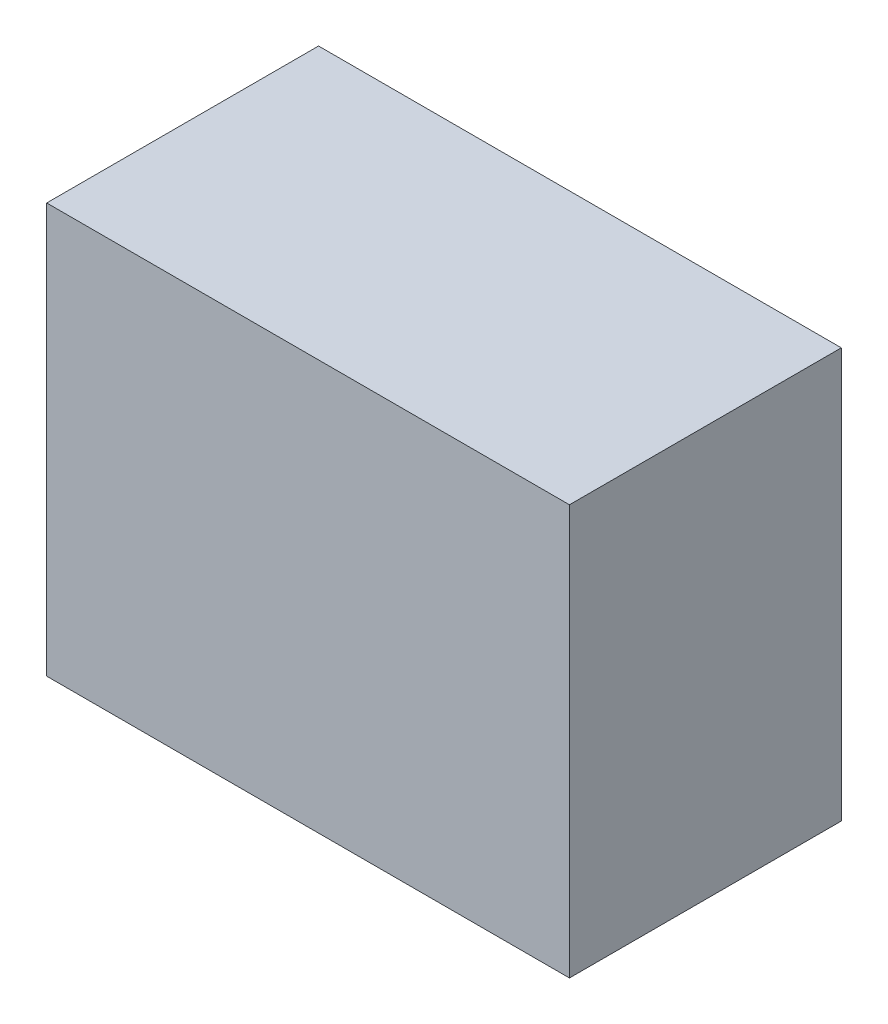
ISO-10303-21;
HEADER;
FILE_DESCRIPTION(('STEP AP214'),'2;1');
FILE_NAME('part.step','',(''),(''),'','','');
FILE_SCHEMA(('AUTOMOTIVE_DESIGN { 1 0 10303 214 1 1 1 1 }'));
ENDSEC;
DATA;
#1=APPLICATION_CONTEXT('core data for automotive mechanical design processes');
#2=APPLICATION_PROTOCOL_DEFINITION('international standard','automotive_design',2000,#1);
#3=PRODUCT_CONTEXT('',#1,'mechanical');
#4=PRODUCT('Part','Part','',(#3));
#5=PRODUCT_RELATED_PRODUCT_CATEGORY('part','',(#4));
#6=PRODUCT_DEFINITION_FORMATION('','',#4);
#7=PRODUCT_DEFINITION_CONTEXT('part definition',#1,'design');
#8=PRODUCT_DEFINITION('design','',#6,#7);
#9=PRODUCT_DEFINITION_SHAPE('','',#8);
#10=(LENGTH_UNIT() NAMED_UNIT(*) SI_UNIT(.MILLI.,.METRE.));
#11=(NAMED_UNIT(*) PLANE_ANGLE_UNIT() SI_UNIT($,.RADIAN.));
#12=(NAMED_UNIT(*) SI_UNIT($,.STERADIAN.) SOLID_ANGLE_UNIT());
#13=UNCERTAINTY_MEASURE_WITH_UNIT(LENGTH_MEASURE(1.E-05),#10,'distance_accuracy_value','');
#14=(GEOMETRIC_REPRESENTATION_CONTEXT(3) GLOBAL_UNCERTAINTY_ASSIGNED_CONTEXT((#13)) GLOBAL_UNIT_ASSIGNED_CONTEXT((#10,
#11,#12)) REPRESENTATION_CONTEXT('',''));
#15=CARTESIAN_POINT('',(0.,0.,0.));
#16=DIRECTION('',(0.,0.,1.));
#17=DIRECTION('',(1.,0.,0.));
#18=AXIS2_PLACEMENT_3D('',#15,#16,#17);
#19=CARTESIAN_POINT('',(-40.3021650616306,32.3007964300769,50.8));
#20=DIRECTION('',(1.,0.,0.));
#21=DIRECTION('',(0.,0.,-1.));
#22=AXIS2_PLACEMENT_3D('',#19,#20,#21);
#23=PLANE('',#22);
#24=DIRECTION('',(0.,-1.,0.));
#25=VECTOR('',#24,1.);
#26=CARTESIAN_POINT('',(-40.3021650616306,32.3007964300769,0.));
#27=LINE('',#26,#25);
#28=CARTESIAN_POINT('',(-40.3021650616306,32.3007964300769,0.));
#29=VERTEX_POINT('',#28);
#30=CARTESIAN_POINT('',(-40.3021650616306,-44.2826803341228,0.));
#31=VERTEX_POINT('',#30);
#32=EDGE_CURVE('E94',#29,#31,#27,.T.);
#33=ORIENTED_EDGE('',*,*,#32,.T.);
#34=DIRECTION('',(0.,0.,-1.));
#35=VECTOR('',#34,1.);
#36=CARTESIAN_POINT('',(-40.3021650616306,-44.2826803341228,50.8));
#37=LINE('',#36,#35);
#38=CARTESIAN_POINT('',(-40.3021650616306,-44.2826803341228,50.8));
#39=VERTEX_POINT('',#38);
#40=EDGE_CURVE('E11',#39,#31,#37,.T.);
#41=ORIENTED_EDGE('',*,*,#40,.F.);
#42=DIRECTION('',(0.,-1.,0.));
#43=VECTOR('',#42,1.);
#44=CARTESIAN_POINT('',(-40.3021650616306,32.3007964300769,50.8));
#45=LINE('',#44,#43);
#46=CARTESIAN_POINT('',(-40.3021650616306,32.3007964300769,50.8));
#47=VERTEX_POINT('',#46);
#48=EDGE_CURVE('E82',#47,#39,#45,.T.);
#49=ORIENTED_EDGE('',*,*,#48,.F.);
#50=DIRECTION('',(0.,0.,-1.));
#51=VECTOR('',#50,1.);
#52=CARTESIAN_POINT('',(-40.3021650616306,32.3007964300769,50.8));
#53=LINE('',#52,#51);
#54=EDGE_CURVE('E90',#47,#29,#53,.T.);
#55=ORIENTED_EDGE('',*,*,#54,.T.);
#56=EDGE_LOOP('',(#33,#41,#49,#55));
#57=FACE_BOUND('',#56,.T.);
#58=ADVANCED_FACE('F31',(#57),#23,.F.);
#59=CARTESIAN_POINT('',(-40.3021650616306,-44.2826803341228,50.8));
#60=DIRECTION('',(0.,1.,0.));
#61=DIRECTION('',(0.,0.,1.));
#62=AXIS2_PLACEMENT_3D('',#59,#60,#61);
#63=PLANE('',#62);
#64=DIRECTION('',(1.,0.,0.));
#65=VECTOR('',#64,1.);
#66=CARTESIAN_POINT('',(-40.3021650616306,-44.2826803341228,0.));
#67=LINE('',#66,#65);
#68=CARTESIAN_POINT('',(57.384314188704,-44.2826803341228,0.));
#69=VERTEX_POINT('',#68);
#70=EDGE_CURVE('E86',#31,#69,#67,.T.);
#71=ORIENTED_EDGE('',*,*,#70,.T.);
#72=DIRECTION('',(0.,0.,-1.));
#73=VECTOR('',#72,1.);
#74=CARTESIAN_POINT('',(57.384314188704,-44.2826803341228,50.8));
#75=LINE('',#74,#73);
#76=CARTESIAN_POINT('',(57.384314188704,-44.2826803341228,50.8));
#77=VERTEX_POINT('',#76);
#78=EDGE_CURVE('E39',#77,#69,#75,.T.);
#79=ORIENTED_EDGE('',*,*,#78,.F.);
#80=DIRECTION('',(1.,0.,0.));
#81=VECTOR('',#80,1.);
#82=CARTESIAN_POINT('',(-40.3021650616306,-44.2826803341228,50.8));
#83=LINE('',#82,#81);
#84=EDGE_CURVE('E77',#39,#77,#83,.T.);
#85=ORIENTED_EDGE('',*,*,#84,.F.);
#86=ORIENTED_EDGE('',*,*,#40,.T.);
#87=EDGE_LOOP('',(#71,#79,#85,#86));
#88=FACE_BOUND('',#87,.T.);
#89=ADVANCED_FACE('F85',(#88),#63,.F.);
#90=CARTESIAN_POINT('',(57.384314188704,32.3007964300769,50.8));
#91=DIRECTION('',(-1.,0.,0.));
#92=DIRECTION('',(0.,0.,1.));
#93=AXIS2_PLACEMENT_3D('',#90,#91,#92);
#94=PLANE('',#93);
#95=DIRECTION('',(0.,1.,0.));
#96=VECTOR('',#95,1.);
#97=CARTESIAN_POINT('',(57.384314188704,32.3007964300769,0.));
#98=LINE('',#97,#96);
#99=CARTESIAN_POINT('',(57.384314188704,32.3007964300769,0.));
#100=VERTEX_POINT('',#99);
#101=EDGE_CURVE('E64',#69,#100,#98,.T.);
#102=ORIENTED_EDGE('',*,*,#101,.T.);
#103=DIRECTION('',(0.,0.,-1.));
#104=VECTOR('',#103,1.);
#105=CARTESIAN_POINT('',(57.384314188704,32.3007964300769,50.8));
#106=LINE('',#105,#104);
#107=CARTESIAN_POINT('',(57.384314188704,32.3007964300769,50.8));
#108=VERTEX_POINT('',#107);
#109=EDGE_CURVE('E87',#108,#100,#106,.T.);
#110=ORIENTED_EDGE('',*,*,#109,.F.);
#111=DIRECTION('',(0.,1.,0.));
#112=VECTOR('',#111,1.);
#113=CARTESIAN_POINT('',(57.384314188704,32.3007964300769,50.8));
#114=LINE('',#113,#112);
#115=EDGE_CURVE('E80',#77,#108,#114,.T.);
#116=ORIENTED_EDGE('',*,*,#115,.F.);
#117=ORIENTED_EDGE('',*,*,#78,.T.);
#118=EDGE_LOOP('',(#102,#110,#116,#117));
#119=FACE_BOUND('',#118,.T.);
#120=ADVANCED_FACE('F88',(#119),#94,.F.);
#121=CARTESIAN_POINT('',(-40.3021650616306,32.3007964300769,50.8));
#122=DIRECTION('',(0.,-1.,0.));
#123=DIRECTION('',(0.,0.,-1.));
#124=AXIS2_PLACEMENT_3D('',#121,#122,#123);
#125=PLANE('',#124);
#126=DIRECTION('',(-1.,0.,0.));
#127=VECTOR('',#126,1.);
#128=CARTESIAN_POINT('',(-40.3021650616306,32.3007964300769,0.));
#129=LINE('',#128,#127);
#130=EDGE_CURVE('E70',#100,#29,#129,.T.);
#131=ORIENTED_EDGE('',*,*,#130,.T.);
#132=ORIENTED_EDGE('',*,*,#54,.F.);
#133=DIRECTION('',(-1.,0.,0.));
#134=VECTOR('',#133,1.);
#135=CARTESIAN_POINT('',(-40.3021650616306,32.3007964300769,50.8));
#136=LINE('',#135,#134);
#137=EDGE_CURVE('E47',#108,#47,#136,.T.);
#138=ORIENTED_EDGE('',*,*,#137,.F.);
#139=ORIENTED_EDGE('',*,*,#109,.T.);
#140=EDGE_LOOP('',(#131,#132,#138,#139));
#141=FACE_BOUND('',#140,.T.);
#142=ADVANCED_FACE('F101',(#141),#125,.F.);
#143=CARTESIAN_POINT('',(-40.3021650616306,-44.2826803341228,50.8));
#144=DIRECTION('',(0.,0.,1.));
#145=DIRECTION('',(1.,0.,0.));
#146=AXIS2_PLACEMENT_3D('',#143,#144,#145);
#147=PLANE('',#146);
#148=ORIENTED_EDGE('',*,*,#48,.T.);
#149=ORIENTED_EDGE('',*,*,#84,.T.);
#150=ORIENTED_EDGE('',*,*,#115,.T.);
#151=ORIENTED_EDGE('',*,*,#137,.T.);
#152=EDGE_LOOP('',(#148,#149,#150,#151));
#153=FACE_BOUND('',#152,.T.);
#154=ADVANCED_FACE('F78',(#153),#147,.T.);
#155=CARTESIAN_POINT('',(-40.3021650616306,-44.2826803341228,0.));
#156=DIRECTION('',(0.,0.,1.));
#157=DIRECTION('',(1.,0.,0.));
#158=AXIS2_PLACEMENT_3D('',#155,#156,#157);
#159=PLANE('',#158);
#160=ORIENTED_EDGE('',*,*,#32,.F.);
#161=ORIENTED_EDGE('',*,*,#130,.F.);
#162=ORIENTED_EDGE('',*,*,#101,.F.);
#163=ORIENTED_EDGE('',*,*,#70,.F.);
#164=EDGE_LOOP('',(#160,#161,#162,#163));
#165=FACE_BOUND('',#164,.T.);
#166=ADVANCED_FACE('F104',(#165),#159,.F.);
#167=CLOSED_SHELL('',(#58,#89,#120,#142,#154,#166));
#168=MANIFOLD_SOLID_BREP('B2',#167);
#169=ADVANCED_BREP_SHAPE_REPRESENTATION('',(#18,#168),#14);
#170=SHAPE_DEFINITION_REPRESENTATION(#9,#169);
ENDSEC;
END-ISO-10303-21;
